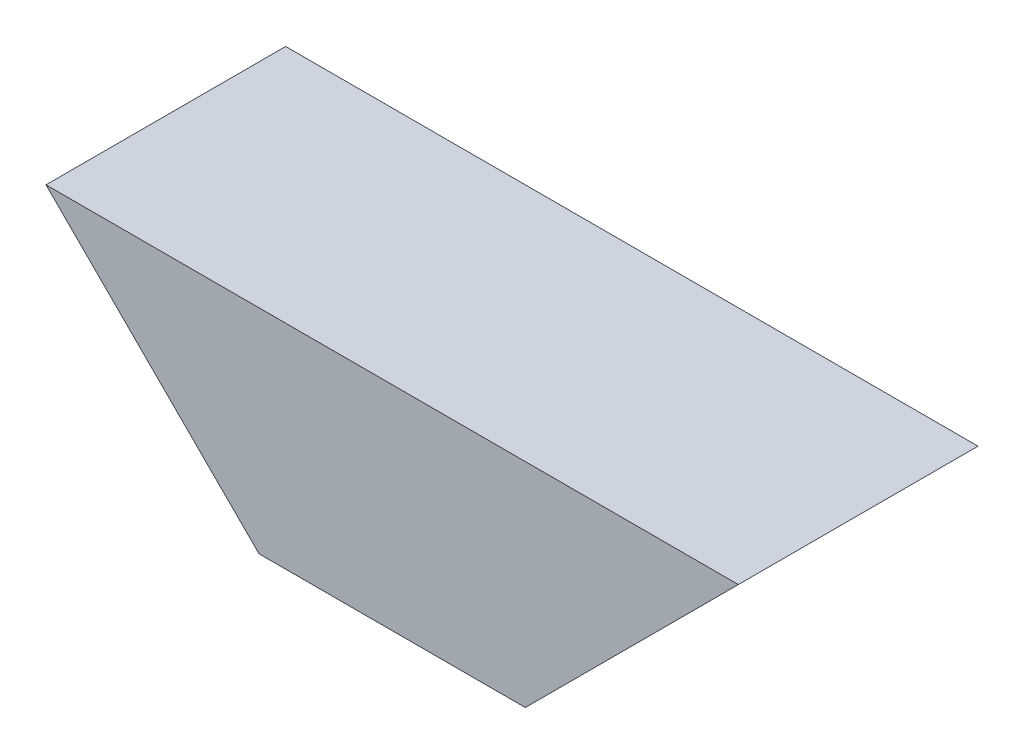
from build123d import *

# Parameters (mm, degrees)
BOSS_EXTRUDE1_DEPTH = 90


with BuildPart() as part:
    # Sketch1 → Boss-Extrude1 (new body)
    with BuildSketch(Plane.XY):
        Polygon((-50, 0), (50, 0), (130, 80), (-130, 80), align=None)
    extrude(amount=BOSS_EXTRUDE1_DEPTH)


solid = part.part
